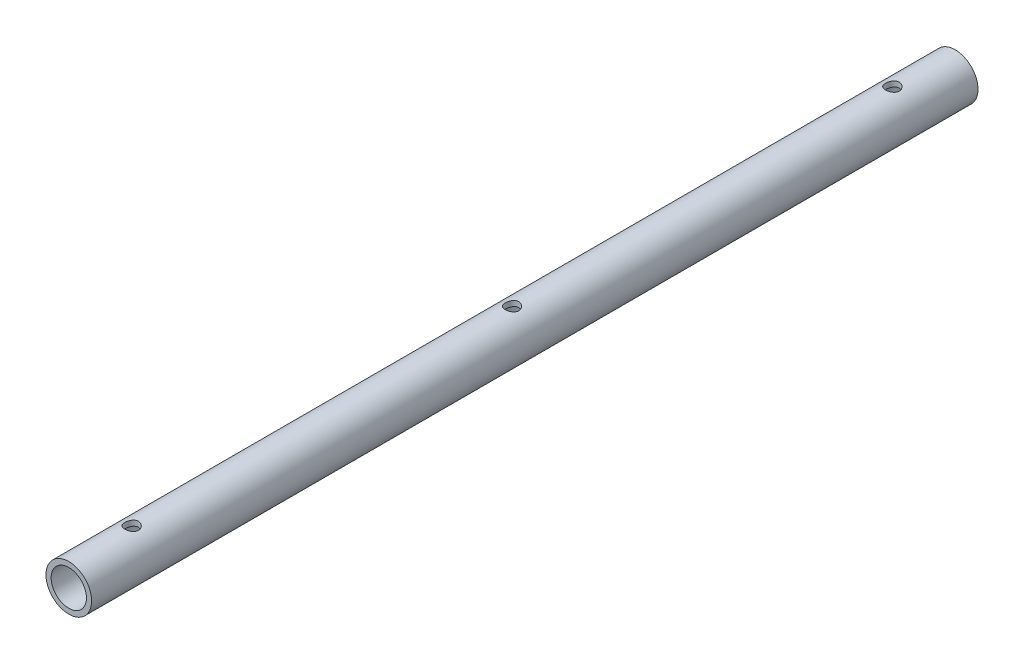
from build123d import *

# Parameters (mm, degrees)
SKETCH1_R          = 10.668
SKETCH1_R_2        = 8.255
EXTRUDE1_DEPTH     = 207.1624
SKETCH2_R          = 3.2004
CUT_EXTRUDE1_DEPTH = 209.531271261
LPATTERN1_COUNT    = 2
LPATTERN1_PITCH    = 177.8
LPATTERN2_COUNT    = 2
LPATTERN2_PITCH    = 177.8


with BuildPart() as part:
    # Sketch1 → Extrude1 (new, symmetric)
    with BuildSketch(Plane.XY):
        Circle(SKETCH1_R)
        Circle(SKETCH1_R_2, mode=Mode.SUBTRACT)
    extrude(amount=EXTRUDE1_DEPTH, both=True)

    # Sketch2 → Cut-Extrude1 (cut, through all)
    with BuildSketch(Plane(origin=(0, 10.668, 0), x_dir=(-1, 0, 0), z_dir=(0, 1, 0))):
        with Locations(Location((0, 0, 0), (0, 0, 90))):
            Circle(SKETCH2_R)
    cut_extrude1 = extrude(amount=-CUT_EXTRUDE1_DEPTH, mode=Mode.SUBTRACT)

    # LPattern1: Cut-Extrude1 ×2
    with Locations(*[(0, 0, i * LPATTERN1_PITCH) for i in range(1, LPATTERN1_COUNT)]):
        add(cut_extrude1, mode=Mode.SUBTRACT)

    # LPattern2: Cut-Extrude1 ×2
    with Locations(*[(0, 0, -i * LPATTERN2_PITCH) for i in range(1, LPATTERN2_COUNT)]):
        add(cut_extrude1, mode=Mode.SUBTRACT)


solid = part.part
